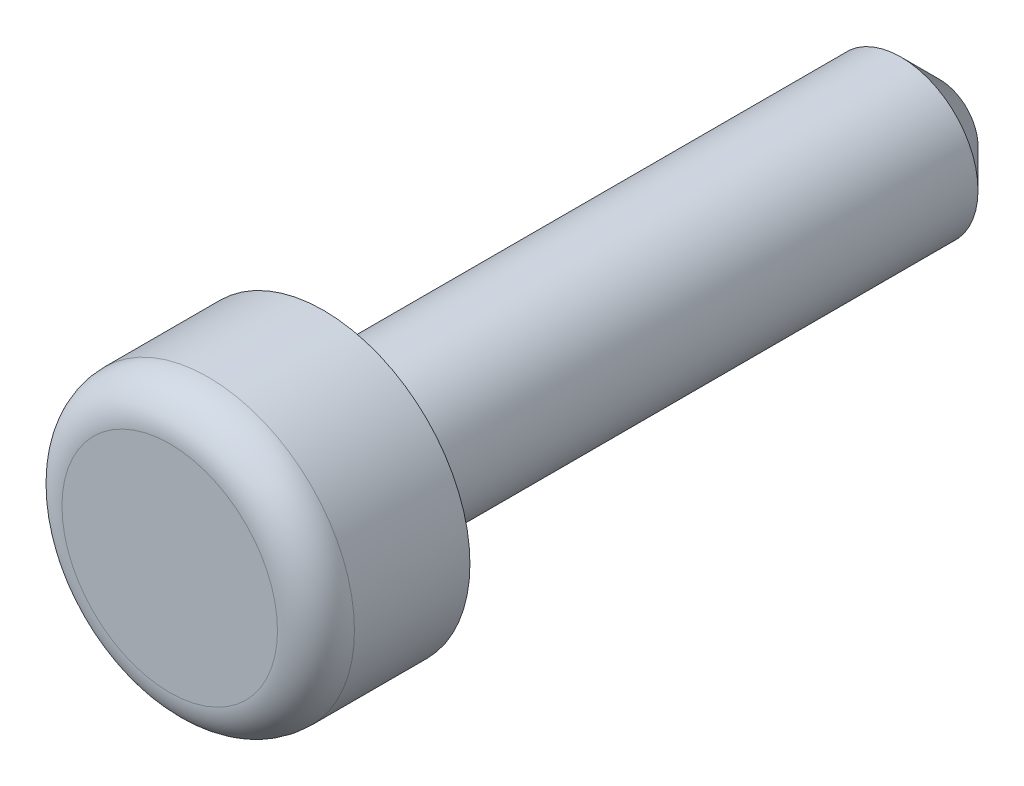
ISO-10303-21;
HEADER;
FILE_DESCRIPTION(('STEP AP214'),'2;1');
FILE_NAME('part.step','',(''),(''),'','','');
FILE_SCHEMA(('AUTOMOTIVE_DESIGN { 1 0 10303 214 1 1 1 1 }'));
ENDSEC;
DATA;
#1=APPLICATION_CONTEXT('core data for automotive mechanical design processes');
#2=APPLICATION_PROTOCOL_DEFINITION('international standard','automotive_design',2000,#1);
#3=PRODUCT_CONTEXT('',#1,'mechanical');
#4=PRODUCT('Part','Part','',(#3));
#5=PRODUCT_RELATED_PRODUCT_CATEGORY('part','',(#4));
#6=PRODUCT_DEFINITION_FORMATION('','',#4);
#7=PRODUCT_DEFINITION_CONTEXT('part definition',#1,'design');
#8=PRODUCT_DEFINITION('design','',#6,#7);
#9=PRODUCT_DEFINITION_SHAPE('','',#8);
#10=(LENGTH_UNIT() NAMED_UNIT(*) SI_UNIT(.MILLI.,.METRE.));
#11=(NAMED_UNIT(*) PLANE_ANGLE_UNIT() SI_UNIT($,.RADIAN.));
#12=(NAMED_UNIT(*) SI_UNIT($,.STERADIAN.) SOLID_ANGLE_UNIT());
#13=UNCERTAINTY_MEASURE_WITH_UNIT(LENGTH_MEASURE(1.E-05),#10,'distance_accuracy_value','');
#14=(GEOMETRIC_REPRESENTATION_CONTEXT(3) GLOBAL_UNCERTAINTY_ASSIGNED_CONTEXT((#13)) GLOBAL_UNIT_ASSIGNED_CONTEXT((#10,
#11,#12)) REPRESENTATION_CONTEXT('',''));
#15=CARTESIAN_POINT('',(0.,0.,0.));
#16=DIRECTION('',(0.,0.,1.));
#17=DIRECTION('',(1.,0.,0.));
#18=AXIS2_PLACEMENT_3D('',#15,#16,#17);
#19=CARTESIAN_POINT('',(0.,0.,2.));
#20=DIRECTION('',(0.,0.,1.));
#21=DIRECTION('',(1.,0.,0.));
#22=AXIS2_PLACEMENT_3D('',#19,#20,#21);
#23=PLANE('',#22);
#24=CARTESIAN_POINT('',(0.,0.,2.));
#25=DIRECTION('',(0.,0.,-1.));
#26=DIRECTION('',(1.,0.,0.));
#27=AXIS2_PLACEMENT_3D('',#24,#25,#26);
#28=CIRCLE('',#27,1.4);
#29=CARTESIAN_POINT('',(1.4,0.,2.));
#30=VERTEX_POINT('',#29);
#31=CARTESIAN_POINT('',(-1.4,0.,2.));
#32=VERTEX_POINT('',#31);
#33=EDGE_CURVE('E37',#30,#32,#28,.T.);
#34=ORIENTED_EDGE('',*,*,#33,.F.);
#35=CARTESIAN_POINT('',(0.,0.,2.));
#36=DIRECTION('',(0.,0.,-1.));
#37=DIRECTION('',(-1.,0.,0.));
#38=AXIS2_PLACEMENT_3D('',#35,#36,#37);
#39=CIRCLE('',#38,1.4);
#40=EDGE_CURVE('E33',#32,#30,#39,.T.);
#41=ORIENTED_EDGE('',*,*,#40,.F.);
#42=EDGE_LOOP('',(#34,#41));
#43=FACE_BOUND('',#42,.T.);
#44=ADVANCED_FACE('F16',(#43),#23,.T.);
#45=CARTESIAN_POINT('',(0.,0.,1.5));
#46=DIRECTION('',(0.,0.,1.));
#47=DIRECTION('',(1.,0.,0.));
#48=AXIS2_PLACEMENT_3D('',#45,#46,#47);
#49=TOROIDAL_SURFACE('',#48,1.4,0.5);
#50=CARTESIAN_POINT('',(0.,0.,1.5));
#51=DIRECTION('',(0.,0.,1.));
#52=DIRECTION('',(1.,0.,0.));
#53=AXIS2_PLACEMENT_3D('',#50,#51,#52);
#54=CIRCLE('',#53,1.9);
#55=CARTESIAN_POINT('',(1.9,0.,1.5));
#56=VERTEX_POINT('',#55);
#57=EDGE_CURVE('E43',#56,#56,#54,.F.);
#58=ORIENTED_EDGE('',*,*,#57,.F.);
#59=EDGE_LOOP('',(#58));
#60=FACE_BOUND('',#59,.T.);
#61=ORIENTED_EDGE('',*,*,#33,.T.);
#62=ORIENTED_EDGE('',*,*,#40,.T.);
#63=EDGE_LOOP('',(#61,#62));
#64=FACE_BOUND('',#63,.T.);
#65=ADVANCED_FACE('F42',(#60,#64),#49,.T.);
#66=CARTESIAN_POINT('',(0.,0.,-8.));
#67=DIRECTION('',(0.,0.,-1.));
#68=DIRECTION('',(-1.,0.,0.));
#69=AXIS2_PLACEMENT_3D('',#66,#67,#68);
#70=PLANE('',#69);
#71=CARTESIAN_POINT('',(0.,0.,-7.99999999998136));
#72=DIRECTION('',(0.,0.,1.));
#73=DIRECTION('',(1.,0.,0.));
#74=AXIS2_PLACEMENT_3D('',#71,#72,#73);
#75=CIRCLE('',#74,0.499999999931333);
#76=CARTESIAN_POINT('',(0.499999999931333,0.,-7.99999999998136));
#77=VERTEX_POINT('',#76);
#78=EDGE_CURVE('E74',#77,#77,#75,.T.);
#79=ORIENTED_EDGE('',*,*,#78,.F.);
#80=EDGE_LOOP('',(#79));
#81=FACE_BOUND('',#80,.T.);
#82=ADVANCED_FACE('F59',(#81),#70,.T.);
#83=CARTESIAN_POINT('',(0.,0.,0.));
#84=DIRECTION('',(0.,0.,1.));
#85=DIRECTION('',(1.,0.,0.));
#86=AXIS2_PLACEMENT_3D('',#83,#84,#85);
#87=CYLINDRICAL_SURFACE('',#86,1.9);
#88=ORIENTED_EDGE('',*,*,#57,.T.);
#89=EDGE_LOOP('',(#88));
#90=FACE_BOUND('',#89,.T.);
#91=CARTESIAN_POINT('',(0.,0.,0.));
#92=DIRECTION('',(0.,0.,1.));
#93=DIRECTION('',(1.,0.,0.));
#94=AXIS2_PLACEMENT_3D('',#91,#92,#93);
#95=CIRCLE('',#94,1.9);
#96=CARTESIAN_POINT('',(1.9,0.,0.));
#97=VERTEX_POINT('',#96);
#98=EDGE_CURVE('E76',#97,#97,#95,.T.);
#99=ORIENTED_EDGE('',*,*,#98,.T.);
#100=EDGE_LOOP('',(#99));
#101=FACE_BOUND('',#100,.T.);
#102=ADVANCED_FACE('F89',(#90,#101),#87,.T.);
#103=CARTESIAN_POINT('',(0.,0.,-7.50000000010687));
#104=DIRECTION('',(0.,0.,1.));
#105=DIRECTION('',(1.,0.,0.));
#106=AXIS2_PLACEMENT_3D('',#103,#104,#105);
#107=CONICAL_SURFACE('',#106,0.999999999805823,0.785398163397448);
#108=CARTESIAN_POINT('',(0.,0.,-7.5));
#109=DIRECTION('',(0.,0.,-1.));
#110=DIRECTION('',(-1.,0.,0.));
#111=AXIS2_PLACEMENT_3D('',#108,#109,#110);
#112=CIRCLE('',#111,1.);
#113=CARTESIAN_POINT('',(-1.,0.,-7.5));
#114=VERTEX_POINT('',#113);
#115=EDGE_CURVE('E27',#114,#114,#112,.F.);
#116=ORIENTED_EDGE('',*,*,#115,.F.);
#117=EDGE_LOOP('',(#116));
#118=FACE_BOUND('',#117,.T.);
#119=ORIENTED_EDGE('',*,*,#78,.T.);
#120=EDGE_LOOP('',(#119));
#121=FACE_BOUND('',#120,.T.);
#122=ADVANCED_FACE('F86',(#118,#121),#107,.T.);
#123=CARTESIAN_POINT('',(0.,0.,0.));
#124=DIRECTION('',(0.,0.,1.));
#125=DIRECTION('',(1.,0.,0.));
#126=AXIS2_PLACEMENT_3D('',#123,#124,#125);
#127=PLANE('',#126);
#128=CARTESIAN_POINT('',(0.,0.,0.));
#129=DIRECTION('',(0.,0.,-1.));
#130=DIRECTION('',(-1.,0.,0.));
#131=AXIS2_PLACEMENT_3D('',#128,#129,#130);
#132=CIRCLE('',#131,1.);
#133=CARTESIAN_POINT('',(-1.,0.,0.));
#134=VERTEX_POINT('',#133);
#135=EDGE_CURVE('E11',#134,#134,#132,.T.);
#136=ORIENTED_EDGE('',*,*,#135,.F.);
#137=EDGE_LOOP('',(#136));
#138=FACE_BOUND('',#137,.T.);
#139=ORIENTED_EDGE('',*,*,#98,.F.);
#140=EDGE_LOOP('',(#139));
#141=FACE_BOUND('',#140,.T.);
#142=ADVANCED_FACE('F97',(#138,#141),#127,.F.);
#143=CARTESIAN_POINT('',(0.,0.,0.));
#144=DIRECTION('',(0.,0.,-1.));
#145=DIRECTION('',(-1.,0.,0.));
#146=AXIS2_PLACEMENT_3D('',#143,#144,#145);
#147=CYLINDRICAL_SURFACE('',#146,1.);
#148=ORIENTED_EDGE('',*,*,#115,.T.);
#149=EDGE_LOOP('',(#148));
#150=FACE_BOUND('',#149,.T.);
#151=ORIENTED_EDGE('',*,*,#135,.T.);
#152=EDGE_LOOP('',(#151));
#153=FACE_BOUND('',#152,.T.);
#154=ADVANCED_FACE('F95',(#150,#153),#147,.T.);
#155=CLOSED_SHELL('',(#44,#65,#82,#102,#122,#142,#154));
#156=MANIFOLD_SOLID_BREP('B1',#155);
#157=ADVANCED_BREP_SHAPE_REPRESENTATION('',(#18,#156),#14);
#158=SHAPE_DEFINITION_REPRESENTATION(#9,#157);
ENDSEC;
END-ISO-10303-21;
